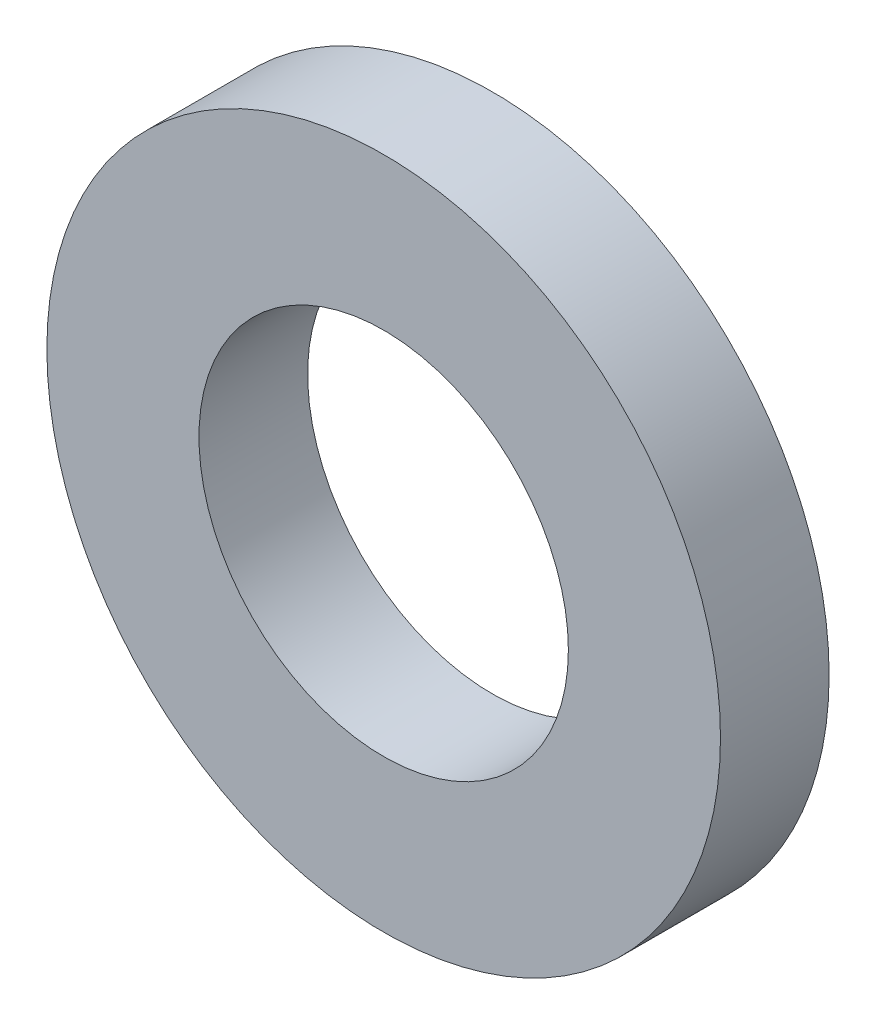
ISO-10303-21;
HEADER;
FILE_DESCRIPTION(('STEP AP214'),'2;1');
FILE_NAME('part.step','',(''),(''),'','','');
FILE_SCHEMA(('AUTOMOTIVE_DESIGN { 1 0 10303 214 1 1 1 1 }'));
ENDSEC;
DATA;
#1=APPLICATION_CONTEXT('core data for automotive mechanical design processes');
#2=APPLICATION_PROTOCOL_DEFINITION('international standard','automotive_design',2000,#1);
#3=PRODUCT_CONTEXT('',#1,'mechanical');
#4=PRODUCT('Part','Part','',(#3));
#5=PRODUCT_RELATED_PRODUCT_CATEGORY('part','',(#4));
#6=PRODUCT_DEFINITION_FORMATION('','',#4);
#7=PRODUCT_DEFINITION_CONTEXT('part definition',#1,'design');
#8=PRODUCT_DEFINITION('design','',#6,#7);
#9=PRODUCT_DEFINITION_SHAPE('','',#8);
#10=(LENGTH_UNIT() NAMED_UNIT(*) SI_UNIT(.MILLI.,.METRE.));
#11=(NAMED_UNIT(*) PLANE_ANGLE_UNIT() SI_UNIT($,.RADIAN.));
#12=(NAMED_UNIT(*) SI_UNIT($,.STERADIAN.) SOLID_ANGLE_UNIT());
#13=UNCERTAINTY_MEASURE_WITH_UNIT(LENGTH_MEASURE(1.E-05),#10,'distance_accuracy_value','');
#14=(GEOMETRIC_REPRESENTATION_CONTEXT(3) GLOBAL_UNCERTAINTY_ASSIGNED_CONTEXT((#13)) GLOBAL_UNIT_ASSIGNED_CONTEXT((#10,
#11,#12)) REPRESENTATION_CONTEXT('',''));
#15=CARTESIAN_POINT('',(0.,0.,0.));
#16=DIRECTION('',(0.,0.,1.));
#17=DIRECTION('',(1.,0.,0.));
#18=AXIS2_PLACEMENT_3D('',#15,#16,#17);
#19=CARTESIAN_POINT('',(0.,0.,5.));
#20=DIRECTION('',(0.,0.,1.));
#21=DIRECTION('',(1.,0.,0.));
#22=AXIS2_PLACEMENT_3D('',#19,#20,#21);
#23=PLANE('',#22);
#24=CARTESIAN_POINT('',(0.,0.,5.));
#25=DIRECTION('',(0.,0.,1.));
#26=DIRECTION('',(1.,0.,0.));
#27=AXIS2_PLACEMENT_3D('',#24,#25,#26);
#28=CIRCLE('',#27,15.5);
#29=CARTESIAN_POINT('',(15.5,0.,5.));
#30=VERTEX_POINT('',#29);
#31=EDGE_CURVE('E8',#30,#30,#28,.T.);
#32=ORIENTED_EDGE('',*,*,#31,.T.);
#33=EDGE_LOOP('',(#32));
#34=FACE_BOUND('',#33,.T.);
#35=CARTESIAN_POINT('',(0.,0.,5.));
#36=DIRECTION('',(0.,0.,1.));
#37=DIRECTION('',(1.,0.,0.));
#38=AXIS2_PLACEMENT_3D('',#35,#36,#37);
#39=CIRCLE('',#38,8.5);
#40=CARTESIAN_POINT('',(8.5,0.,5.));
#41=VERTEX_POINT('',#40);
#42=EDGE_CURVE('E23',#41,#41,#39,.T.);
#43=ORIENTED_EDGE('',*,*,#42,.F.);
#44=EDGE_LOOP('',(#43));
#45=FACE_BOUND('',#44,.T.);
#46=ADVANCED_FACE('F12',(#34,#45),#23,.T.);
#47=CARTESIAN_POINT('',(0.,0.,0.));
#48=DIRECTION('',(0.,0.,1.));
#49=DIRECTION('',(1.,0.,0.));
#50=AXIS2_PLACEMENT_3D('',#47,#48,#49);
#51=PLANE('',#50);
#52=CARTESIAN_POINT('',(0.,0.,0.));
#53=DIRECTION('',(0.,0.,1.));
#54=DIRECTION('',(1.,0.,0.));
#55=AXIS2_PLACEMENT_3D('',#52,#53,#54);
#56=CIRCLE('',#55,15.5);
#57=CARTESIAN_POINT('',(15.5,0.,0.));
#58=VERTEX_POINT('',#57);
#59=EDGE_CURVE('E19',#58,#58,#56,.T.);
#60=ORIENTED_EDGE('',*,*,#59,.F.);
#61=EDGE_LOOP('',(#60));
#62=FACE_BOUND('',#61,.T.);
#63=CARTESIAN_POINT('',(0.,0.,0.));
#64=DIRECTION('',(0.,0.,1.));
#65=DIRECTION('',(1.,0.,0.));
#66=AXIS2_PLACEMENT_3D('',#63,#64,#65);
#67=CIRCLE('',#66,8.5);
#68=CARTESIAN_POINT('',(8.5,0.,0.));
#69=VERTEX_POINT('',#68);
#70=EDGE_CURVE('E27',#69,#69,#67,.T.);
#71=ORIENTED_EDGE('',*,*,#70,.T.);
#72=EDGE_LOOP('',(#71));
#73=FACE_BOUND('',#72,.T.);
#74=ADVANCED_FACE('F33',(#62,#73),#51,.F.);
#75=CARTESIAN_POINT('',(0.,0.,5.));
#76=DIRECTION('',(0.,0.,-1.));
#77=DIRECTION('',(-1.,0.,0.));
#78=AXIS2_PLACEMENT_3D('',#75,#76,#77);
#79=CYLINDRICAL_SURFACE('',#78,15.5);
#80=ORIENTED_EDGE('',*,*,#31,.F.);
#81=EDGE_LOOP('',(#80));
#82=FACE_BOUND('',#81,.T.);
#83=ORIENTED_EDGE('',*,*,#59,.T.);
#84=EDGE_LOOP('',(#83));
#85=FACE_BOUND('',#84,.T.);
#86=ADVANCED_FACE('F14',(#82,#85),#79,.T.);
#87=CARTESIAN_POINT('',(0.,0.,5.));
#88=DIRECTION('',(0.,0.,-1.));
#89=DIRECTION('',(-1.,0.,0.));
#90=AXIS2_PLACEMENT_3D('',#87,#88,#89);
#91=CYLINDRICAL_SURFACE('',#90,8.5);
#92=ORIENTED_EDGE('',*,*,#42,.T.);
#93=EDGE_LOOP('',(#92));
#94=FACE_BOUND('',#93,.T.);
#95=ORIENTED_EDGE('',*,*,#70,.F.);
#96=EDGE_LOOP('',(#95));
#97=FACE_BOUND('',#96,.T.);
#98=ADVANCED_FACE('F35',(#94,#97),#91,.F.);
#99=CLOSED_SHELL('',(#46,#74,#86,#98));
#100=MANIFOLD_SOLID_BREP('B1',#99);
#101=ADVANCED_BREP_SHAPE_REPRESENTATION('',(#18,#100),#14);
#102=SHAPE_DEFINITION_REPRESENTATION(#9,#101);
ENDSEC;
END-ISO-10303-21;
